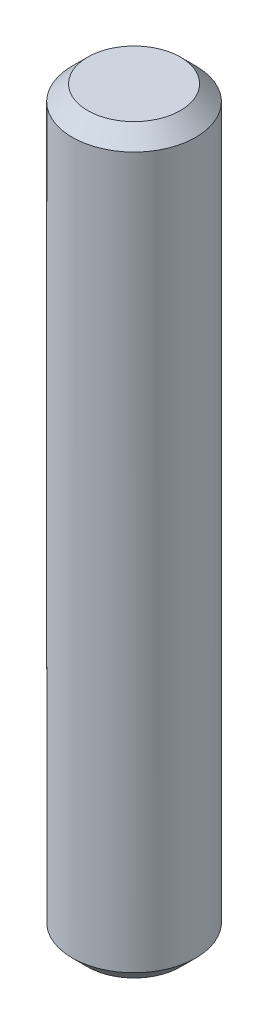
from build123d import *

# Parameters (mm, degrees)
SKETCH1_R      = 25.4
EXTRUDE1_DEPTH = 152.4
CHAMFER1_SIZE  = 6.35


with BuildPart() as part:
    # Sketch1 → Extrude1 (new, symmetric)
    with BuildSketch(Plane(origin=(0, 0, 0), x_dir=(1, 0, 0), z_dir=(0, 1, 0))):
        with Locations(Location((0, 0, 0), (0, 0, 90))):
            Circle(SKETCH1_R)
    extrude(amount=EXTRUDE1_DEPTH, both=True)

    # Chamfer1
    chamfer1_edges = [part.edges().sort_by_distance(p)[0] for p in [
        (0, -152.4, 25.4),
        (0, 152.4, 25.4),
    ]]
    chamfer(chamfer1_edges, length=CHAMFER1_SIZE)


solid = part.part
